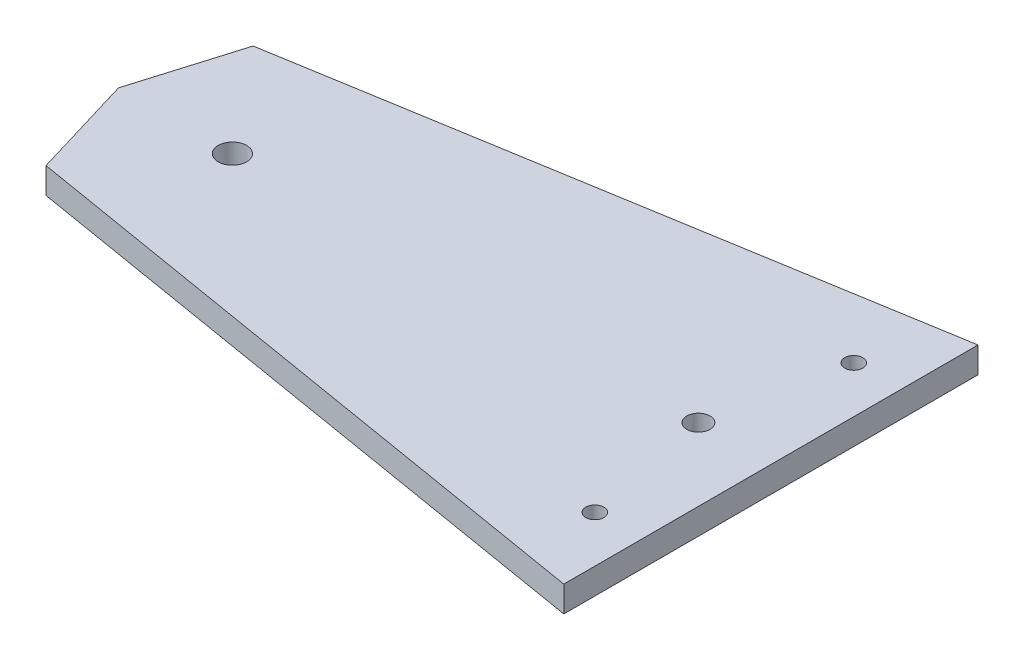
ISO-10303-21;
HEADER;
FILE_DESCRIPTION(('STEP AP214'),'2;1');
FILE_NAME('part.step','',(''),(''),'','','');
FILE_SCHEMA(('AUTOMOTIVE_DESIGN { 1 0 10303 214 1 1 1 1 }'));
ENDSEC;
DATA;
#1=APPLICATION_CONTEXT('core data for automotive mechanical design processes');
#2=APPLICATION_PROTOCOL_DEFINITION('international standard','automotive_design',2000,#1);
#3=PRODUCT_CONTEXT('',#1,'mechanical');
#4=PRODUCT('Part','Part','',(#3));
#5=PRODUCT_RELATED_PRODUCT_CATEGORY('part','',(#4));
#6=PRODUCT_DEFINITION_FORMATION('','',#4);
#7=PRODUCT_DEFINITION_CONTEXT('part definition',#1,'design');
#8=PRODUCT_DEFINITION('design','',#6,#7);
#9=PRODUCT_DEFINITION_SHAPE('','',#8);
#10=(LENGTH_UNIT() NAMED_UNIT(*) SI_UNIT(.MILLI.,.METRE.));
#11=(NAMED_UNIT(*) PLANE_ANGLE_UNIT() SI_UNIT($,.RADIAN.));
#12=(NAMED_UNIT(*) SI_UNIT($,.STERADIAN.) SOLID_ANGLE_UNIT());
#13=UNCERTAINTY_MEASURE_WITH_UNIT(LENGTH_MEASURE(1.E-05),#10,'distance_accuracy_value','');
#14=(GEOMETRIC_REPRESENTATION_CONTEXT(3) GLOBAL_UNCERTAINTY_ASSIGNED_CONTEXT((#13)) GLOBAL_UNIT_ASSIGNED_CONTEXT((#10,
#11,#12)) REPRESENTATION_CONTEXT('',''));
#15=CARTESIAN_POINT('',(0.,0.,0.));
#16=DIRECTION('',(0.,0.,1.));
#17=DIRECTION('',(1.,0.,0.));
#18=AXIS2_PLACEMENT_3D('',#15,#16,#17);
#19=CARTESIAN_POINT('',(6.,-5.,20.));
#20=DIRECTION('',(-0.957826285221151,0.,0.287347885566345));
#21=DIRECTION('',(0.287347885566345,0.,0.957826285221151));
#22=AXIS2_PLACEMENT_3D('',#19,#20,#21);
#23=PLANE('',#22);
#24=DIRECTION('',(0.287347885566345,0.,0.957826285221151));
#25=VECTOR('',#24,1.);
#26=CARTESIAN_POINT('',(6.,0.,20.));
#27=LINE('',#26,#25);
#28=CARTESIAN_POINT('',(0.,0.,0.));
#29=VERTEX_POINT('',#28);
#30=CARTESIAN_POINT('',(6.,0.,20.));
#31=VERTEX_POINT('',#30);
#32=EDGE_CURVE('E110',#29,#31,#27,.T.);
#33=ORIENTED_EDGE('',*,*,#32,.F.);
#34=DIRECTION('',(0.,1.,0.));
#35=VECTOR('',#34,1.);
#36=CARTESIAN_POINT('',(0.,-5.,0.));
#37=LINE('',#36,#35);
#38=CARTESIAN_POINT('',(0.,-5.,0.));
#39=VERTEX_POINT('',#38);
#40=EDGE_CURVE('E11',#39,#29,#37,.T.);
#41=ORIENTED_EDGE('',*,*,#40,.F.);
#42=DIRECTION('',(0.287347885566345,0.,0.957826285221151));
#43=VECTOR('',#42,1.);
#44=CARTESIAN_POINT('',(6.,-5.,20.));
#45=LINE('',#44,#43);
#46=CARTESIAN_POINT('',(6.,-5.,20.));
#47=VERTEX_POINT('',#46);
#48=EDGE_CURVE('E105',#39,#47,#45,.T.);
#49=ORIENTED_EDGE('',*,*,#48,.T.);
#50=DIRECTION('',(0.,1.,0.));
#51=VECTOR('',#50,1.);
#52=CARTESIAN_POINT('',(6.,-5.,20.));
#53=LINE('',#52,#51);
#54=EDGE_CURVE('E36',#47,#31,#53,.T.);
#55=ORIENTED_EDGE('',*,*,#54,.T.);
#56=EDGE_LOOP('',(#33,#41,#49,#55));
#57=FACE_BOUND('',#56,.T.);
#58=ADVANCED_FACE('F33',(#57),#23,.T.);
#59=CARTESIAN_POINT('',(6.,-5.,-20.));
#60=DIRECTION('',(-0.957826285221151,0.,-0.287347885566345));
#61=DIRECTION('',(-0.287347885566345,0.,0.957826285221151));
#62=AXIS2_PLACEMENT_3D('',#59,#60,#61);
#63=PLANE('',#62);
#64=DIRECTION('',(-0.287347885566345,0.,0.957826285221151));
#65=VECTOR('',#64,1.);
#66=CARTESIAN_POINT('',(6.,0.,-20.));
#67=LINE('',#66,#65);
#68=CARTESIAN_POINT('',(6.,0.,-20.));
#69=VERTEX_POINT('',#68);
#70=EDGE_CURVE('E120',#69,#29,#67,.T.);
#71=ORIENTED_EDGE('',*,*,#70,.F.);
#72=DIRECTION('',(0.,1.,0.));
#73=VECTOR('',#72,1.);
#74=CARTESIAN_POINT('',(6.,-5.,-20.));
#75=LINE('',#74,#73);
#76=CARTESIAN_POINT('',(6.,-5.,-20.));
#77=VERTEX_POINT('',#76);
#78=EDGE_CURVE('E42',#77,#69,#75,.T.);
#79=ORIENTED_EDGE('',*,*,#78,.F.);
#80=DIRECTION('',(-0.287347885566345,0.,0.957826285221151));
#81=VECTOR('',#80,1.);
#82=CARTESIAN_POINT('',(6.,-5.,-20.));
#83=LINE('',#82,#81);
#84=EDGE_CURVE('E100',#77,#39,#83,.T.);
#85=ORIENTED_EDGE('',*,*,#84,.T.);
#86=ORIENTED_EDGE('',*,*,#40,.T.);
#87=EDGE_LOOP('',(#71,#79,#85,#86));
#88=FACE_BOUND('',#87,.T.);
#89=ADVANCED_FACE('F126',(#88),#63,.T.);
#90=CARTESIAN_POINT('',(126.,-5.,-40.));
#91=DIRECTION('',(-0.164398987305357,0.,-0.986393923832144));
#92=DIRECTION('',(-0.986393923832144,0.,0.164398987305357));
#93=AXIS2_PLACEMENT_3D('',#90,#91,#92);
#94=PLANE('',#93);
#95=DIRECTION('',(-0.986393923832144,0.,0.164398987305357));
#96=VECTOR('',#95,1.);
#97=CARTESIAN_POINT('',(126.,0.,-40.));
#98=LINE('',#97,#96);
#99=CARTESIAN_POINT('',(126.,0.,-40.));
#100=VERTEX_POINT('',#99);
#101=EDGE_CURVE('E89',#100,#69,#98,.T.);
#102=ORIENTED_EDGE('',*,*,#101,.F.);
#103=DIRECTION('',(0.,1.,0.));
#104=VECTOR('',#103,1.);
#105=CARTESIAN_POINT('',(126.,-5.,-40.));
#106=LINE('',#105,#104);
#107=CARTESIAN_POINT('',(126.,-5.,-40.));
#108=VERTEX_POINT('',#107);
#109=EDGE_CURVE('E84',#108,#100,#106,.T.);
#110=ORIENTED_EDGE('',*,*,#109,.F.);
#111=DIRECTION('',(-0.986393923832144,0.,0.164398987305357));
#112=VECTOR('',#111,1.);
#113=CARTESIAN_POINT('',(126.,-5.,-40.));
#114=LINE('',#113,#112);
#115=EDGE_CURVE('E87',#108,#77,#114,.T.);
#116=ORIENTED_EDGE('',*,*,#115,.T.);
#117=ORIENTED_EDGE('',*,*,#78,.T.);
#118=EDGE_LOOP('',(#102,#110,#116,#117));
#119=FACE_BOUND('',#118,.T.);
#120=ADVANCED_FACE('F86',(#119),#94,.T.);
#121=CARTESIAN_POINT('',(126.,-5.,40.));
#122=DIRECTION('',(1.,0.,0.));
#123=DIRECTION('',(0.,0.,-1.));
#124=AXIS2_PLACEMENT_3D('',#121,#122,#123);
#125=PLANE('',#124);
#126=DIRECTION('',(0.,0.,-1.));
#127=VECTOR('',#126,1.);
#128=CARTESIAN_POINT('',(126.,0.,40.));
#129=LINE('',#128,#127);
#130=CARTESIAN_POINT('',(126.,0.,40.));
#131=VERTEX_POINT('',#130);
#132=EDGE_CURVE('E117',#131,#100,#129,.T.);
#133=ORIENTED_EDGE('',*,*,#132,.F.);
#134=DIRECTION('',(0.,1.,0.));
#135=VECTOR('',#134,1.);
#136=CARTESIAN_POINT('',(126.,-5.,40.));
#137=LINE('',#136,#135);
#138=CARTESIAN_POINT('',(126.,-5.,40.));
#139=VERTEX_POINT('',#138);
#140=EDGE_CURVE('E94',#139,#131,#137,.T.);
#141=ORIENTED_EDGE('',*,*,#140,.F.);
#142=DIRECTION('',(0.,0.,-1.));
#143=VECTOR('',#142,1.);
#144=CARTESIAN_POINT('',(126.,-5.,40.));
#145=LINE('',#144,#143);
#146=EDGE_CURVE('E99',#139,#108,#145,.T.);
#147=ORIENTED_EDGE('',*,*,#146,.T.);
#148=ORIENTED_EDGE('',*,*,#109,.T.);
#149=EDGE_LOOP('',(#133,#141,#147,#148));
#150=FACE_BOUND('',#149,.T.);
#151=ADVANCED_FACE('F102',(#150),#125,.T.);
#152=CARTESIAN_POINT('',(126.,-5.,40.));
#153=DIRECTION('',(-0.164398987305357,0.,0.986393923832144));
#154=DIRECTION('',(0.986393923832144,0.,0.164398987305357));
#155=AXIS2_PLACEMENT_3D('',#152,#153,#154);
#156=PLANE('',#155);
#157=DIRECTION('',(0.986393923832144,0.,0.164398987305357));
#158=VECTOR('',#157,1.);
#159=CARTESIAN_POINT('',(126.,0.,40.));
#160=LINE('',#159,#158);
#161=EDGE_CURVE('E113',#31,#131,#160,.T.);
#162=ORIENTED_EDGE('',*,*,#161,.F.);
#163=ORIENTED_EDGE('',*,*,#54,.F.);
#164=DIRECTION('',(0.986393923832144,0.,0.164398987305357));
#165=VECTOR('',#164,1.);
#166=CARTESIAN_POINT('',(126.,-5.,40.));
#167=LINE('',#166,#165);
#168=EDGE_CURVE('E103',#47,#139,#167,.T.);
#169=ORIENTED_EDGE('',*,*,#168,.T.);
#170=ORIENTED_EDGE('',*,*,#140,.T.);
#171=EDGE_LOOP('',(#162,#163,#169,#170));
#172=FACE_BOUND('',#171,.T.);
#173=ADVANCED_FACE('F123',(#172),#156,.T.);
#174=CARTESIAN_POINT('',(0.,-5.,0.));
#175=DIRECTION('',(0.,1.,0.));
#176=DIRECTION('',(0.,0.,1.));
#177=AXIS2_PLACEMENT_3D('',#174,#175,#176);
#178=PLANE('',#177);
#179=CARTESIAN_POINT('',(117.,-5.,25.));
#180=DIRECTION('',(0.,1.,0.));
#181=DIRECTION('',(0.,0.,-1.));
#182=AXIS2_PLACEMENT_3D('',#179,#180,#181);
#183=CIRCLE('',#182,1.75);
#184=CARTESIAN_POINT('',(117.,-5.,23.25));
#185=VERTEX_POINT('',#184);
#186=EDGE_CURVE('E169',#185,#185,#183,.T.);
#187=ORIENTED_EDGE('',*,*,#186,.T.);
#188=EDGE_LOOP('',(#187));
#189=FACE_BOUND('',#188,.T.);
#190=CARTESIAN_POINT('',(117.,-5.,-25.));
#191=DIRECTION('',(0.,1.,0.));
#192=DIRECTION('',(0.,0.,1.));
#193=AXIS2_PLACEMENT_3D('',#190,#191,#192);
#194=CIRCLE('',#193,1.75);
#195=CARTESIAN_POINT('',(117.,-5.,-23.25));
#196=VERTEX_POINT('',#195);
#197=EDGE_CURVE('E177',#196,#196,#194,.T.);
#198=ORIENTED_EDGE('',*,*,#197,.T.);
#199=EDGE_LOOP('',(#198));
#200=FACE_BOUND('',#199,.T.);
#201=CARTESIAN_POINT('',(112.,-5.,0.));
#202=DIRECTION('',(0.,1.,0.));
#203=DIRECTION('',(0.,0.,1.));
#204=AXIS2_PLACEMENT_3D('',#201,#202,#203);
#205=CIRCLE('',#204,2.25);
#206=CARTESIAN_POINT('',(112.,-5.,2.25));
#207=VERTEX_POINT('',#206);
#208=EDGE_CURVE('E183',#207,#207,#205,.T.);
#209=ORIENTED_EDGE('',*,*,#208,.T.);
#210=EDGE_LOOP('',(#209));
#211=FACE_BOUND('',#210,.T.);
#212=CARTESIAN_POINT('',(22.,-5.,0.));
#213=DIRECTION('',(0.,1.,0.));
#214=DIRECTION('',(0.,0.,1.));
#215=AXIS2_PLACEMENT_3D('',#212,#213,#214);
#216=CIRCLE('',#215,2.75);
#217=CARTESIAN_POINT('',(22.,-5.,2.75));
#218=VERTEX_POINT('',#217);
#219=EDGE_CURVE('E114',#218,#218,#216,.T.);
#220=ORIENTED_EDGE('',*,*,#219,.T.);
#221=EDGE_LOOP('',(#220));
#222=FACE_BOUND('',#221,.T.);
#223=ORIENTED_EDGE('',*,*,#48,.F.);
#224=ORIENTED_EDGE('',*,*,#84,.F.);
#225=ORIENTED_EDGE('',*,*,#115,.F.);
#226=ORIENTED_EDGE('',*,*,#146,.F.);
#227=ORIENTED_EDGE('',*,*,#168,.F.);
#228=EDGE_LOOP('',(#223,#224,#225,#226,#227));
#229=FACE_BOUND('',#228,.T.);
#230=ADVANCED_FACE('F98',(#189,#200,#211,#222,#229),#178,.F.);
#231=CARTESIAN_POINT('',(0.,0.,0.));
#232=DIRECTION('',(0.,1.,0.));
#233=DIRECTION('',(0.,0.,1.));
#234=AXIS2_PLACEMENT_3D('',#231,#232,#233);
#235=PLANE('',#234);
#236=CARTESIAN_POINT('',(117.,0.,25.));
#237=DIRECTION('',(0.,1.,0.));
#238=DIRECTION('',(0.,0.,-1.));
#239=AXIS2_PLACEMENT_3D('',#236,#237,#238);
#240=CIRCLE('',#239,1.75);
#241=CARTESIAN_POINT('',(117.,0.,23.25));
#242=VERTEX_POINT('',#241);
#243=EDGE_CURVE('E172',#242,#242,#240,.T.);
#244=ORIENTED_EDGE('',*,*,#243,.F.);
#245=EDGE_LOOP('',(#244));
#246=FACE_BOUND('',#245,.T.);
#247=CARTESIAN_POINT('',(117.,0.,-25.));
#248=DIRECTION('',(0.,1.,0.));
#249=DIRECTION('',(0.,0.,1.));
#250=AXIS2_PLACEMENT_3D('',#247,#248,#249);
#251=CIRCLE('',#250,1.75);
#252=CARTESIAN_POINT('',(117.,0.,-23.25));
#253=VERTEX_POINT('',#252);
#254=EDGE_CURVE('E174',#253,#253,#251,.T.);
#255=ORIENTED_EDGE('',*,*,#254,.F.);
#256=EDGE_LOOP('',(#255));
#257=FACE_BOUND('',#256,.T.);
#258=CARTESIAN_POINT('',(112.,0.,0.));
#259=DIRECTION('',(0.,1.,0.));
#260=DIRECTION('',(0.,0.,1.));
#261=AXIS2_PLACEMENT_3D('',#258,#259,#260);
#262=CIRCLE('',#261,2.25);
#263=CARTESIAN_POINT('',(112.,0.,2.25));
#264=VERTEX_POINT('',#263);
#265=EDGE_CURVE('E180',#264,#264,#262,.T.);
#266=ORIENTED_EDGE('',*,*,#265,.F.);
#267=EDGE_LOOP('',(#266));
#268=FACE_BOUND('',#267,.T.);
#269=CARTESIAN_POINT('',(22.,0.,0.));
#270=DIRECTION('',(0.,1.,0.));
#271=DIRECTION('',(0.,0.,1.));
#272=AXIS2_PLACEMENT_3D('',#269,#270,#271);
#273=CIRCLE('',#272,2.75);
#274=CARTESIAN_POINT('',(22.,0.,2.75));
#275=VERTEX_POINT('',#274);
#276=EDGE_CURVE('E186',#275,#275,#273,.T.);
#277=ORIENTED_EDGE('',*,*,#276,.F.);
#278=EDGE_LOOP('',(#277));
#279=FACE_BOUND('',#278,.T.);
#280=ORIENTED_EDGE('',*,*,#32,.T.);
#281=ORIENTED_EDGE('',*,*,#161,.T.);
#282=ORIENTED_EDGE('',*,*,#132,.T.);
#283=ORIENTED_EDGE('',*,*,#101,.T.);
#284=ORIENTED_EDGE('',*,*,#70,.T.);
#285=EDGE_LOOP('',(#280,#281,#282,#283,#284));
#286=FACE_BOUND('',#285,.T.);
#287=ADVANCED_FACE('F125',(#246,#257,#268,#279,#286),#235,.T.);
#288=CARTESIAN_POINT('',(22.,-5.,0.));
#289=DIRECTION('',(0.,1.,0.));
#290=DIRECTION('',(0.,0.,1.));
#291=AXIS2_PLACEMENT_3D('',#288,#289,#290);
#292=CYLINDRICAL_SURFACE('',#291,2.75);
#293=ORIENTED_EDGE('',*,*,#219,.F.);
#294=EDGE_LOOP('',(#293));
#295=FACE_BOUND('',#294,.T.);
#296=ORIENTED_EDGE('',*,*,#276,.T.);
#297=EDGE_LOOP('',(#296));
#298=FACE_BOUND('',#297,.T.);
#299=ADVANCED_FACE('F146',(#295,#298),#292,.F.);
#300=CARTESIAN_POINT('',(112.,-5.,0.));
#301=DIRECTION('',(0.,1.,0.));
#302=DIRECTION('',(0.,0.,1.));
#303=AXIS2_PLACEMENT_3D('',#300,#301,#302);
#304=CYLINDRICAL_SURFACE('',#303,2.25);
#305=ORIENTED_EDGE('',*,*,#208,.F.);
#306=EDGE_LOOP('',(#305));
#307=FACE_BOUND('',#306,.T.);
#308=ORIENTED_EDGE('',*,*,#265,.T.);
#309=EDGE_LOOP('',(#308));
#310=FACE_BOUND('',#309,.T.);
#311=ADVANCED_FACE('F153',(#307,#310),#304,.F.);
#312=CARTESIAN_POINT('',(117.,-5.,-25.));
#313=DIRECTION('',(0.,1.,0.));
#314=DIRECTION('',(0.,0.,1.));
#315=AXIS2_PLACEMENT_3D('',#312,#313,#314);
#316=CYLINDRICAL_SURFACE('',#315,1.75);
#317=ORIENTED_EDGE('',*,*,#197,.F.);
#318=EDGE_LOOP('',(#317));
#319=FACE_BOUND('',#318,.T.);
#320=ORIENTED_EDGE('',*,*,#254,.T.);
#321=EDGE_LOOP('',(#320));
#322=FACE_BOUND('',#321,.T.);
#323=ADVANCED_FACE('F157',(#319,#322),#316,.F.);
#324=CARTESIAN_POINT('',(117.,-5.,25.));
#325=DIRECTION('',(0.,1.,0.));
#326=DIRECTION('',(0.,0.,1.));
#327=AXIS2_PLACEMENT_3D('',#324,#325,#326);
#328=CYLINDRICAL_SURFACE('',#327,1.75);
#329=ORIENTED_EDGE('',*,*,#186,.F.);
#330=EDGE_LOOP('',(#329));
#331=FACE_BOUND('',#330,.T.);
#332=ORIENTED_EDGE('',*,*,#243,.T.);
#333=EDGE_LOOP('',(#332));
#334=FACE_BOUND('',#333,.T.);
#335=ADVANCED_FACE('F161',(#331,#334),#328,.F.);
#336=CLOSED_SHELL('',(#58,#89,#120,#151,#173,#230,#287,#299,#311,#323,#335));
#337=MANIFOLD_SOLID_BREP('B2',#336);
#338=ADVANCED_BREP_SHAPE_REPRESENTATION('',(#18,#337),#14);
#339=SHAPE_DEFINITION_REPRESENTATION(#9,#338);
ENDSEC;
END-ISO-10303-21;
